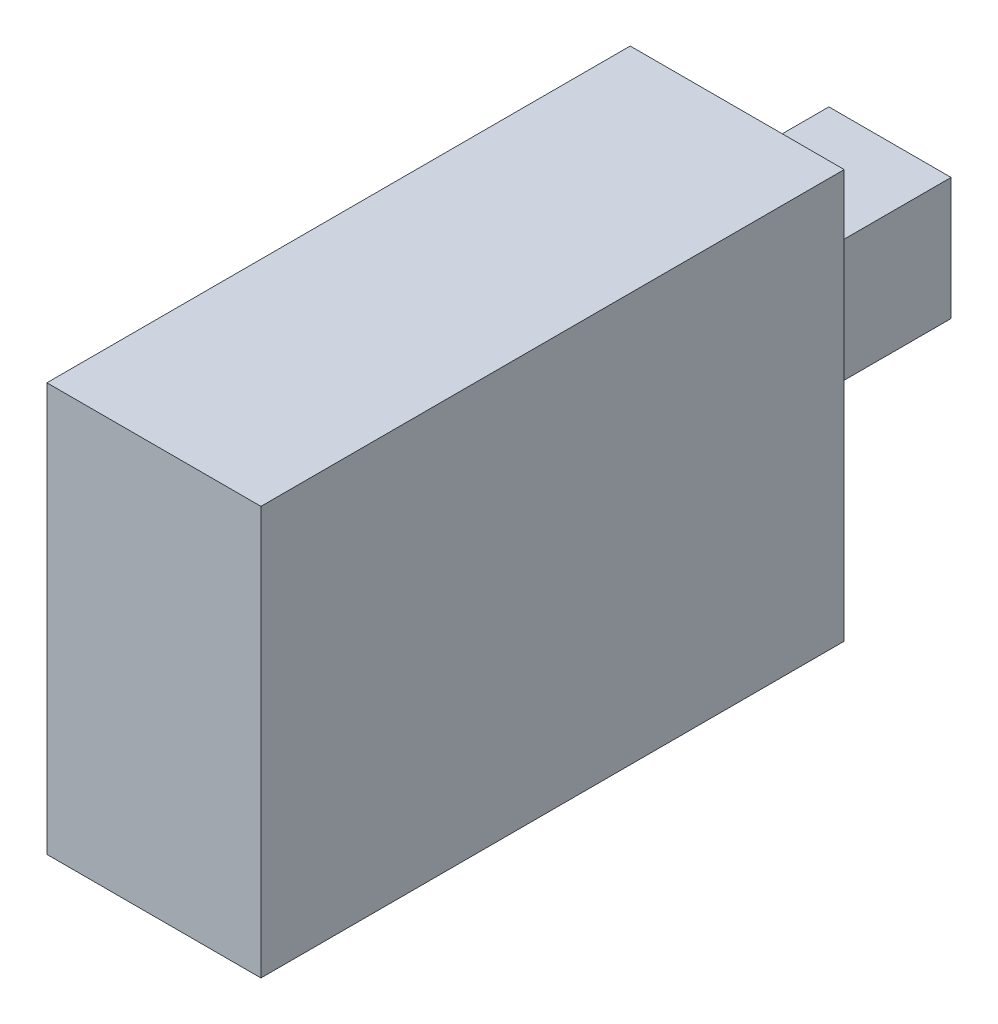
ISO-10303-21;
HEADER;
FILE_DESCRIPTION(('STEP AP214'),'2;1');
FILE_NAME('part.step','',(''),(''),'','','');
FILE_SCHEMA(('AUTOMOTIVE_DESIGN { 1 0 10303 214 1 1 1 1 }'));
ENDSEC;
DATA;
#1=APPLICATION_CONTEXT('core data for automotive mechanical design processes');
#2=APPLICATION_PROTOCOL_DEFINITION('international standard','automotive_design',2000,#1);
#3=PRODUCT_CONTEXT('',#1,'mechanical');
#4=PRODUCT('Part','Part','',(#3));
#5=PRODUCT_RELATED_PRODUCT_CATEGORY('part','',(#4));
#6=PRODUCT_DEFINITION_FORMATION('','',#4);
#7=PRODUCT_DEFINITION_CONTEXT('part definition',#1,'design');
#8=PRODUCT_DEFINITION('design','',#6,#7);
#9=PRODUCT_DEFINITION_SHAPE('','',#8);
#10=(LENGTH_UNIT() NAMED_UNIT(*) SI_UNIT(.MILLI.,.METRE.));
#11=(NAMED_UNIT(*) PLANE_ANGLE_UNIT() SI_UNIT($,.RADIAN.));
#12=(NAMED_UNIT(*) SI_UNIT($,.STERADIAN.) SOLID_ANGLE_UNIT());
#13=UNCERTAINTY_MEASURE_WITH_UNIT(LENGTH_MEASURE(1.E-05),#10,'distance_accuracy_value','');
#14=(GEOMETRIC_REPRESENTATION_CONTEXT(3) GLOBAL_UNCERTAINTY_ASSIGNED_CONTEXT((#13)) GLOBAL_UNIT_ASSIGNED_CONTEXT((#10,
#11,#12)) REPRESENTATION_CONTEXT('',''));
#15=CARTESIAN_POINT('',(0.,0.,0.));
#16=DIRECTION('',(0.,0.,1.));
#17=DIRECTION('',(1.,0.,0.));
#18=AXIS2_PLACEMENT_3D('',#15,#16,#17);
#19=CARTESIAN_POINT('',(-29.5273999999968,0.,-45.7699999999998));
#20=DIRECTION('',(0.,0.,-1.));
#21=DIRECTION('',(-1.,0.,0.));
#22=AXIS2_PLACEMENT_3D('',#19,#20,#21);
#23=PLANE('',#22);
#24=DIRECTION('',(0.,1.,0.));
#25=VECTOR('',#24,1.);
#26=CARTESIAN_POINT('',(-24.2999999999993,9.4000000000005,-45.7699999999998));
#27=LINE('',#26,#25);
#28=CARTESIAN_POINT('',(-24.2999999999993,5.60000000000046,-45.7699999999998));
#29=VERTEX_POINT('',#28);
#30=CARTESIAN_POINT('',(-24.2999999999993,9.4000000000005,-45.7699999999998));
#31=VERTEX_POINT('',#30);
#32=EDGE_CURVE('E79',#29,#31,#27,.T.);
#33=ORIENTED_EDGE('',*,*,#32,.F.);
#34=DIRECTION('',(1.,0.,0.));
#35=VECTOR('',#34,1.);
#36=CARTESIAN_POINT('',(-24.2999999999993,5.60000000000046,-45.7699999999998));
#37=LINE('',#36,#35);
#38=CARTESIAN_POINT('',(-28.0999999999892,5.60000000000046,-45.7699999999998));
#39=VERTEX_POINT('',#38);
#40=EDGE_CURVE('E81',#39,#29,#37,.T.);
#41=ORIENTED_EDGE('',*,*,#40,.F.);
#42=DIRECTION('',(0.,1.,0.));
#43=VECTOR('',#42,1.);
#44=CARTESIAN_POINT('',(-28.0999999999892,5.60000000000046,-45.7699999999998));
#45=LINE('',#44,#43);
#46=CARTESIAN_POINT('',(-28.0999999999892,9.4000000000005,-45.7699999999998));
#47=VERTEX_POINT('',#46);
#48=EDGE_CURVE('E20',#47,#39,#45,.F.);
#49=ORIENTED_EDGE('',*,*,#48,.F.);
#50=DIRECTION('',(1.,0.,0.));
#51=VECTOR('',#50,1.);
#52=CARTESIAN_POINT('',(-28.0999999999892,9.4000000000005,-45.7699999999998));
#53=LINE('',#52,#51);
#54=EDGE_CURVE('E103',#31,#47,#53,.F.);
#55=ORIENTED_EDGE('',*,*,#54,.F.);
#56=EDGE_LOOP('',(#33,#41,#49,#55));
#57=FACE_BOUND('',#56,.T.);
#58=ADVANCED_FACE('F17',(#57),#23,.T.);
#59=CARTESIAN_POINT('',(-28.0999999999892,5.60000000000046,-41.0199999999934));
#60=DIRECTION('',(-1.,0.,0.));
#61=DIRECTION('',(0.,0.,1.));
#62=AXIS2_PLACEMENT_3D('',#59,#60,#61);
#63=PLANE('',#62);
#64=DIRECTION('',(0.,1.,0.));
#65=VECTOR('',#64,1.);
#66=CARTESIAN_POINT('',(-28.0999999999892,0.,-41.0199999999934));
#67=LINE('',#66,#65);
#68=CARTESIAN_POINT('',(-28.0999999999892,9.4000000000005,-41.0199999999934));
#69=VERTEX_POINT('',#68);
#70=CARTESIAN_POINT('',(-28.0999999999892,5.60000000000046,-41.0199999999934));
#71=VERTEX_POINT('',#70);
#72=EDGE_CURVE('E111',#69,#71,#67,.F.);
#73=ORIENTED_EDGE('',*,*,#72,.F.);
#74=DIRECTION('',(0.,0.,1.));
#75=VECTOR('',#74,1.);
#76=CARTESIAN_POINT('',(-28.0999999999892,9.4000000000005,-41.0199999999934));
#77=LINE('',#76,#75);
#78=EDGE_CURVE('E92',#47,#69,#77,.T.);
#79=ORIENTED_EDGE('',*,*,#78,.F.);
#80=ORIENTED_EDGE('',*,*,#48,.T.);
#81=DIRECTION('',(0.,0.,-1.));
#82=VECTOR('',#81,1.);
#83=CARTESIAN_POINT('',(-28.0999999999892,5.60000000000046,-41.0199999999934));
#84=LINE('',#83,#82);
#85=EDGE_CURVE('E87',#71,#39,#84,.T.);
#86=ORIENTED_EDGE('',*,*,#85,.F.);
#87=EDGE_LOOP('',(#73,#79,#80,#86));
#88=FACE_BOUND('',#87,.T.);
#89=ADVANCED_FACE('F89',(#88),#63,.T.);
#90=CARTESIAN_POINT('',(-24.2999999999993,5.60000000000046,-41.0199999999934));
#91=DIRECTION('',(0.,-1.,0.));
#92=DIRECTION('',(0.,0.,-1.));
#93=AXIS2_PLACEMENT_3D('',#90,#91,#92);
#94=PLANE('',#93);
#95=DIRECTION('',(-1.,0.,0.));
#96=VECTOR('',#95,1.);
#97=CARTESIAN_POINT('',(-22.8725999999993,5.60000000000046,-41.0199999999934));
#98=LINE('',#97,#96);
#99=CARTESIAN_POINT('',(-24.2999999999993,5.60000000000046,-41.0199999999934));
#100=VERTEX_POINT('',#99);
#101=EDGE_CURVE('E96',#71,#100,#98,.F.);
#102=ORIENTED_EDGE('',*,*,#101,.F.);
#103=ORIENTED_EDGE('',*,*,#85,.T.);
#104=ORIENTED_EDGE('',*,*,#40,.T.);
#105=DIRECTION('',(0.,0.,-1.));
#106=VECTOR('',#105,1.);
#107=CARTESIAN_POINT('',(-24.2999999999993,5.60000000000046,-41.0199999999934));
#108=LINE('',#107,#106);
#109=EDGE_CURVE('E99',#100,#29,#108,.T.);
#110=ORIENTED_EDGE('',*,*,#109,.F.);
#111=EDGE_LOOP('',(#102,#103,#104,#110));
#112=FACE_BOUND('',#111,.T.);
#113=ADVANCED_FACE('F94',(#112),#94,.T.);
#114=CARTESIAN_POINT('',(-24.2999999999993,9.4000000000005,-41.0199999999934));
#115=DIRECTION('',(1.,0.,0.));
#116=DIRECTION('',(0.,0.,-1.));
#117=AXIS2_PLACEMENT_3D('',#114,#115,#116);
#118=PLANE('',#117);
#119=DIRECTION('',(0.,1.,0.));
#120=VECTOR('',#119,1.);
#121=CARTESIAN_POINT('',(-24.2999999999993,0.,-41.0199999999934));
#122=LINE('',#121,#120);
#123=CARTESIAN_POINT('',(-24.2999999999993,9.4000000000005,-41.0199999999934));
#124=VERTEX_POINT('',#123);
#125=EDGE_CURVE('E114',#100,#124,#122,.T.);
#126=ORIENTED_EDGE('',*,*,#125,.F.);
#127=ORIENTED_EDGE('',*,*,#109,.T.);
#128=ORIENTED_EDGE('',*,*,#32,.T.);
#129=DIRECTION('',(0.,0.,1.));
#130=VECTOR('',#129,1.);
#131=CARTESIAN_POINT('',(-24.2999999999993,9.4000000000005,-41.0199999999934));
#132=LINE('',#131,#130);
#133=EDGE_CURVE('E106',#124,#31,#132,.F.);
#134=ORIENTED_EDGE('',*,*,#133,.F.);
#135=EDGE_LOOP('',(#126,#127,#128,#134));
#136=FACE_BOUND('',#135,.T.);
#137=ADVANCED_FACE('F209',(#136),#118,.T.);
#138=CARTESIAN_POINT('',(-28.0999999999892,9.4000000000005,-41.0199999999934));
#139=DIRECTION('',(0.,1.,0.));
#140=DIRECTION('',(0.,0.,1.));
#141=AXIS2_PLACEMENT_3D('',#138,#139,#140);
#142=PLANE('',#141);
#143=DIRECTION('',(-1.,0.,0.));
#144=VECTOR('',#143,1.);
#145=CARTESIAN_POINT('',(-22.8725999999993,9.4000000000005,-41.0199999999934));
#146=LINE('',#145,#144);
#147=EDGE_CURVE('E117',#124,#69,#146,.T.);
#148=ORIENTED_EDGE('',*,*,#147,.F.);
#149=ORIENTED_EDGE('',*,*,#133,.T.);
#150=ORIENTED_EDGE('',*,*,#54,.T.);
#151=ORIENTED_EDGE('',*,*,#78,.T.);
#152=EDGE_LOOP('',(#148,#149,#150,#151));
#153=FACE_BOUND('',#152,.T.);
#154=ADVANCED_FACE('F169',(#153),#142,.T.);
#155=CARTESIAN_POINT('',(-22.8725999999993,0.,-22.8840000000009));
#156=DIRECTION('',(1.,0.,0.));
#157=DIRECTION('',(0.,0.,-1.));
#158=AXIS2_PLACEMENT_3D('',#155,#156,#157);
#159=PLANE('',#158);
#160=DIRECTION('',(0.,0.,1.));
#161=VECTOR('',#160,1.);
#162=CARTESIAN_POINT('',(-22.8725999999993,0.,-45.72));
#163=LINE('',#162,#161);
#164=CARTESIAN_POINT('',(-22.8725999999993,0.,-22.8840000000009));
#165=VERTEX_POINT('',#164);
#166=CARTESIAN_POINT('',(-22.8725999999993,0.,-41.0199999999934));
#167=VERTEX_POINT('',#166);
#168=EDGE_CURVE('E127',#165,#167,#163,.F.);
#169=ORIENTED_EDGE('',*,*,#168,.T.);
#170=DIRECTION('',(0.,1.,0.));
#171=VECTOR('',#170,1.);
#172=CARTESIAN_POINT('',(-22.8725999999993,0.,-41.0199999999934));
#173=LINE('',#172,#171);
#174=CARTESIAN_POINT('',(-22.8725999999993,12.7,-41.0199999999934));
#175=VERTEX_POINT('',#174);
#176=EDGE_CURVE('E123',#175,#167,#173,.F.);
#177=ORIENTED_EDGE('',*,*,#176,.F.);
#178=DIRECTION('',(0.,0.,1.));
#179=VECTOR('',#178,1.);
#180=CARTESIAN_POINT('',(-22.8725999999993,12.7,0.));
#181=LINE('',#180,#179);
#182=CARTESIAN_POINT('',(-22.8725999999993,12.7,-22.8840000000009));
#183=VERTEX_POINT('',#182);
#184=EDGE_CURVE('E109',#183,#175,#181,.F.);
#185=ORIENTED_EDGE('',*,*,#184,.F.);
#186=DIRECTION('',(0.,1.,0.));
#187=VECTOR('',#186,1.);
#188=CARTESIAN_POINT('',(-22.8725999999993,0.,-22.8840000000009));
#189=LINE('',#188,#187);
#190=EDGE_CURVE('E134',#165,#183,#189,.T.);
#191=ORIENTED_EDGE('',*,*,#190,.F.);
#192=EDGE_LOOP('',(#169,#177,#185,#191));
#193=FACE_BOUND('',#192,.T.);
#194=ADVANCED_FACE('F155',(#193),#159,.T.);
#195=CARTESIAN_POINT('',(-0.199999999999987,12.7,0.));
#196=DIRECTION('',(0.,1.,0.));
#197=DIRECTION('',(0.,0.,1.));
#198=AXIS2_PLACEMENT_3D('',#195,#196,#197);
#199=PLANE('',#198);
#200=ORIENTED_EDGE('',*,*,#184,.T.);
#201=DIRECTION('',(-1.,0.,0.));
#202=VECTOR('',#201,1.);
#203=CARTESIAN_POINT('',(-22.8725999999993,12.7,-41.0199999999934));
#204=LINE('',#203,#202);
#205=CARTESIAN_POINT('',(-29.5273999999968,12.7,-41.0199999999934));
#206=VERTEX_POINT('',#205);
#207=EDGE_CURVE('E120',#206,#175,#204,.F.);
#208=ORIENTED_EDGE('',*,*,#207,.F.);
#209=DIRECTION('',(0.,0.,1.));
#210=VECTOR('',#209,1.);
#211=CARTESIAN_POINT('',(-29.5273999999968,12.7,-41.0199999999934));
#212=LINE('',#211,#210);
#213=CARTESIAN_POINT('',(-29.5273999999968,12.7,-22.8840000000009));
#214=VERTEX_POINT('',#213);
#215=EDGE_CURVE('E137',#214,#206,#212,.F.);
#216=ORIENTED_EDGE('',*,*,#215,.F.);
#217=DIRECTION('',(1.,0.,0.));
#218=VECTOR('',#217,1.);
#219=CARTESIAN_POINT('',(-29.5273999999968,12.7,-22.8840000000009));
#220=LINE('',#219,#218);
#221=EDGE_CURVE('E130',#183,#214,#220,.F.);
#222=ORIENTED_EDGE('',*,*,#221,.F.);
#223=EDGE_LOOP('',(#200,#208,#216,#222));
#224=FACE_BOUND('',#223,.T.);
#225=ADVANCED_FACE('F160',(#224),#199,.T.);
#226=CARTESIAN_POINT('',(-22.8725999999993,0.,-41.0199999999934));
#227=DIRECTION('',(0.,0.,-1.));
#228=DIRECTION('',(-1.,0.,0.));
#229=AXIS2_PLACEMENT_3D('',#226,#227,#228);
#230=PLANE('',#229);
#231=DIRECTION('',(1.,0.,0.));
#232=VECTOR('',#231,1.);
#233=CARTESIAN_POINT('',(-31.1224119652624,0.,-41.0199999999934));
#234=LINE('',#233,#232);
#235=CARTESIAN_POINT('',(-29.5273999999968,0.,-41.0199999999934));
#236=VERTEX_POINT('',#235);
#237=EDGE_CURVE('E125',#167,#236,#234,.F.);
#238=ORIENTED_EDGE('',*,*,#237,.T.);
#239=DIRECTION('',(0.,1.,0.));
#240=VECTOR('',#239,1.);
#241=CARTESIAN_POINT('',(-29.5273999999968,0.,-41.0199999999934));
#242=LINE('',#241,#240);
#243=EDGE_CURVE('E140',#206,#236,#242,.F.);
#244=ORIENTED_EDGE('',*,*,#243,.F.);
#245=ORIENTED_EDGE('',*,*,#207,.T.);
#246=ORIENTED_EDGE('',*,*,#176,.T.);
#247=EDGE_LOOP('',(#238,#244,#245,#246));
#248=FACE_BOUND('',#247,.T.);
#249=ORIENTED_EDGE('',*,*,#125,.T.);
#250=ORIENTED_EDGE('',*,*,#147,.T.);
#251=ORIENTED_EDGE('',*,*,#72,.T.);
#252=ORIENTED_EDGE('',*,*,#101,.T.);
#253=EDGE_LOOP('',(#249,#250,#251,#252));
#254=FACE_BOUND('',#253,.T.);
#255=ADVANCED_FACE('F151',(#248,#254),#230,.T.);
#256=CARTESIAN_POINT('',(-31.1224119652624,0.,-45.72));
#257=DIRECTION('',(0.,1.,0.));
#258=DIRECTION('',(0.,0.,1.));
#259=AXIS2_PLACEMENT_3D('',#256,#257,#258);
#260=PLANE('',#259);
#261=DIRECTION('',(1.,0.,0.));
#262=VECTOR('',#261,1.);
#263=CARTESIAN_POINT('',(-29.5273999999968,0.,-22.8840000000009));
#264=LINE('',#263,#262);
#265=CARTESIAN_POINT('',(-29.5273999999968,0.,-22.8840000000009));
#266=VERTEX_POINT('',#265);
#267=EDGE_CURVE('E35',#266,#165,#264,.T.);
#268=ORIENTED_EDGE('',*,*,#267,.F.);
#269=DIRECTION('',(0.,0.,1.));
#270=VECTOR('',#269,1.);
#271=CARTESIAN_POINT('',(-29.5273999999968,0.,-41.0199999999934));
#272=LINE('',#271,#270);
#273=EDGE_CURVE('E26',#236,#266,#272,.T.);
#274=ORIENTED_EDGE('',*,*,#273,.F.);
#275=ORIENTED_EDGE('',*,*,#237,.F.);
#276=ORIENTED_EDGE('',*,*,#168,.F.);
#277=EDGE_LOOP('',(#268,#274,#275,#276));
#278=FACE_BOUND('',#277,.T.);
#279=ADVANCED_FACE('F148',(#278),#260,.F.);
#280=CARTESIAN_POINT('',(-29.5273999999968,0.,-22.8840000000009));
#281=DIRECTION('',(0.,0.,1.));
#282=DIRECTION('',(1.,0.,0.));
#283=AXIS2_PLACEMENT_3D('',#280,#281,#282);
#284=PLANE('',#283);
#285=ORIENTED_EDGE('',*,*,#267,.T.);
#286=ORIENTED_EDGE('',*,*,#190,.T.);
#287=ORIENTED_EDGE('',*,*,#221,.T.);
#288=DIRECTION('',(0.,1.,0.));
#289=VECTOR('',#288,1.);
#290=CARTESIAN_POINT('',(-29.5273999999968,0.,-22.8840000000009));
#291=LINE('',#290,#289);
#292=EDGE_CURVE('E11',#266,#214,#291,.T.);
#293=ORIENTED_EDGE('',*,*,#292,.F.);
#294=EDGE_LOOP('',(#285,#286,#287,#293));
#295=FACE_BOUND('',#294,.T.);
#296=ADVANCED_FACE('F158',(#295),#284,.T.);
#297=CARTESIAN_POINT('',(-29.5273999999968,0.,-41.0199999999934));
#298=DIRECTION('',(-1.,0.,0.));
#299=DIRECTION('',(0.,0.,1.));
#300=AXIS2_PLACEMENT_3D('',#297,#298,#299);
#301=PLANE('',#300);
#302=ORIENTED_EDGE('',*,*,#273,.T.);
#303=ORIENTED_EDGE('',*,*,#292,.T.);
#304=ORIENTED_EDGE('',*,*,#215,.T.);
#305=ORIENTED_EDGE('',*,*,#243,.T.);
#306=EDGE_LOOP('',(#302,#303,#304,#305));
#307=FACE_BOUND('',#306,.T.);
#308=ADVANCED_FACE('F145',(#307),#301,.T.);
#309=CLOSED_SHELL('',(#58,#89,#113,#137,#154,#194,#225,#255,#279,#296,#308));
#310=MANIFOLD_SOLID_BREP('B1',#309);
#311=ADVANCED_BREP_SHAPE_REPRESENTATION('',(#18,#310),#14);
#312=SHAPE_DEFINITION_REPRESENTATION(#9,#311);
ENDSEC;
END-ISO-10303-21;
